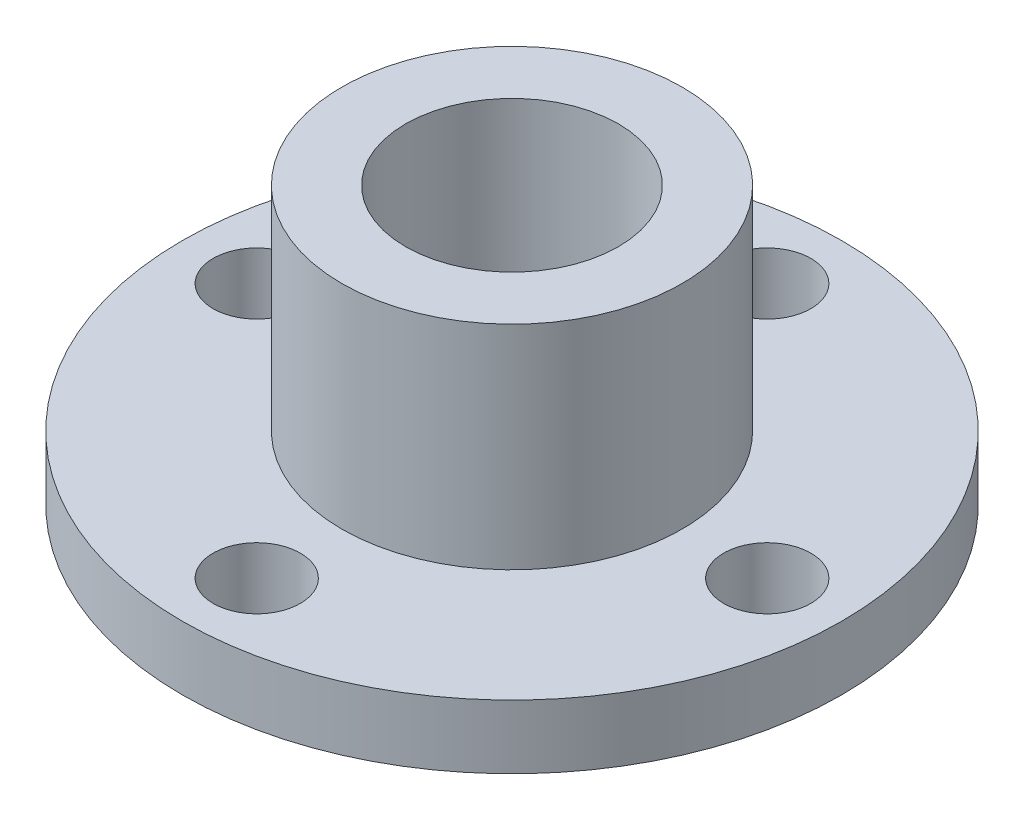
ISO-10303-21;
HEADER;
FILE_DESCRIPTION(('STEP AP214'),'2;1');
FILE_NAME('part.step','',(''),(''),'','','');
FILE_SCHEMA(('AUTOMOTIVE_DESIGN { 1 0 10303 214 1 1 1 1 }'));
ENDSEC;
DATA;
#1=APPLICATION_CONTEXT('core data for automotive mechanical design processes');
#2=APPLICATION_PROTOCOL_DEFINITION('international standard','automotive_design',2000,#1);
#3=PRODUCT_CONTEXT('',#1,'mechanical');
#4=PRODUCT('Part','Part','',(#3));
#5=PRODUCT_RELATED_PRODUCT_CATEGORY('part','',(#4));
#6=PRODUCT_DEFINITION_FORMATION('','',#4);
#7=PRODUCT_DEFINITION_CONTEXT('part definition',#1,'design');
#8=PRODUCT_DEFINITION('design','',#6,#7);
#9=PRODUCT_DEFINITION_SHAPE('','',#8);
#10=(LENGTH_UNIT() NAMED_UNIT(*) SI_UNIT(.MILLI.,.METRE.));
#11=(NAMED_UNIT(*) PLANE_ANGLE_UNIT() SI_UNIT($,.RADIAN.));
#12=(NAMED_UNIT(*) SI_UNIT($,.STERADIAN.) SOLID_ANGLE_UNIT());
#13=UNCERTAINTY_MEASURE_WITH_UNIT(LENGTH_MEASURE(1.E-05),#10,'distance_accuracy_value','');
#14=(GEOMETRIC_REPRESENTATION_CONTEXT(3) GLOBAL_UNCERTAINTY_ASSIGNED_CONTEXT((#13)) GLOBAL_UNIT_ASSIGNED_CONTEXT((#10,
#11,#12)) REPRESENTATION_CONTEXT('',''));
#15=CARTESIAN_POINT('',(0.,0.,0.));
#16=DIRECTION('',(0.,0.,1.));
#17=DIRECTION('',(1.,0.,0.));
#18=AXIS2_PLACEMENT_3D('',#15,#16,#17);
#19=CARTESIAN_POINT('',(0.,3.,0.));
#20=DIRECTION('',(0.,1.,0.));
#21=DIRECTION('',(0.,0.,1.));
#22=AXIS2_PLACEMENT_3D('',#19,#20,#21);
#23=PLANE('',#22);
#24=CARTESIAN_POINT('',(0.,3.,0.));
#25=DIRECTION('',(0.,1.,0.));
#26=DIRECTION('',(0.,0.,1.));
#27=AXIS2_PLACEMENT_3D('',#24,#25,#26);
#28=CIRCLE('',#27,5.);
#29=CARTESIAN_POINT('',(0.,3.,5.));
#30=VERTEX_POINT('',#29);
#31=EDGE_CURVE('E73',#30,#30,#28,.T.);
#32=ORIENTED_EDGE('',*,*,#31,.F.);
#33=EDGE_LOOP('',(#32));
#34=FACE_BOUND('',#33,.T.);
#35=CARTESIAN_POINT('',(0.,3.,0.));
#36=DIRECTION('',(0.,1.,0.));
#37=DIRECTION('',(0.,0.,1.));
#38=AXIS2_PLACEMENT_3D('',#35,#36,#37);
#39=CIRCLE('',#38,5.00319025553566);
#40=CARTESIAN_POINT('',(0.,3.,5.00319025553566));
#41=VERTEX_POINT('',#40);
#42=EDGE_CURVE('E205',#41,#41,#39,.T.);
#43=ORIENTED_EDGE('',*,*,#42,.T.);
#44=EDGE_LOOP('',(#43));
#45=FACE_BOUND('',#44,.T.);
#46=ADVANCED_FACE('F31',(#34,#45),#23,.T.);
#47=CARTESIAN_POINT('',(0.,3.,0.));
#48=DIRECTION('',(0.,1.,0.));
#49=DIRECTION('',(0.,0.,1.));
#50=AXIS2_PLACEMENT_3D('',#47,#48,#49);
#51=CIRCLE('',#50,8.);
#52=CARTESIAN_POINT('',(0.,3.,8.));
#53=VERTEX_POINT('',#52);
#54=EDGE_CURVE('E10',#53,#53,#51,.T.);
#55=ORIENTED_EDGE('',*,*,#54,.F.);
#56=EDGE_LOOP('',(#55));
#57=FACE_BOUND('',#56,.T.);
#58=CARTESIAN_POINT('',(0.,3.,12.));
#59=DIRECTION('',(0.,1.,0.));
#60=DIRECTION('',(0.,0.,1.));
#61=AXIS2_PLACEMENT_3D('',#58,#59,#60);
#62=CIRCLE('',#61,2.05);
#63=CARTESIAN_POINT('',(0.,3.,14.05));
#64=VERTEX_POINT('',#63);
#65=EDGE_CURVE('E55',#64,#64,#62,.T.);
#66=ORIENTED_EDGE('',*,*,#65,.F.);
#67=EDGE_LOOP('',(#66));
#68=FACE_BOUND('',#67,.T.);
#69=CARTESIAN_POINT('',(0.,3.,-12.));
#70=DIRECTION('',(0.,1.,0.));
#71=DIRECTION('',(0.,0.,1.));
#72=AXIS2_PLACEMENT_3D('',#69,#70,#71);
#73=CIRCLE('',#72,2.05);
#74=CARTESIAN_POINT('',(0.,3.,-9.95));
#75=VERTEX_POINT('',#74);
#76=EDGE_CURVE('E67',#75,#75,#73,.T.);
#77=ORIENTED_EDGE('',*,*,#76,.F.);
#78=EDGE_LOOP('',(#77));
#79=FACE_BOUND('',#78,.T.);
#80=CARTESIAN_POINT('',(0.,3.,0.));
#81=DIRECTION('',(0.,1.,0.));
#82=DIRECTION('',(0.,0.,1.));
#83=AXIS2_PLACEMENT_3D('',#80,#81,#82);
#84=CIRCLE('',#83,15.5);
#85=CARTESIAN_POINT('',(0.,3.,15.5));
#86=VERTEX_POINT('',#85);
#87=EDGE_CURVE('E39',#86,#86,#84,.T.);
#88=ORIENTED_EDGE('',*,*,#87,.T.);
#89=EDGE_LOOP('',(#88));
#90=FACE_BOUND('',#89,.T.);
#91=CARTESIAN_POINT('',(12.,3.,0.));
#92=DIRECTION('',(0.,1.,0.));
#93=DIRECTION('',(0.,0.,1.));
#94=AXIS2_PLACEMENT_3D('',#91,#92,#93);
#95=CIRCLE('',#94,2.05);
#96=CARTESIAN_POINT('',(12.,3.,2.05));
#97=VERTEX_POINT('',#96);
#98=EDGE_CURVE('E61',#97,#97,#95,.T.);
#99=ORIENTED_EDGE('',*,*,#98,.F.);
#100=EDGE_LOOP('',(#99));
#101=FACE_BOUND('',#100,.T.);
#102=CARTESIAN_POINT('',(-12.,3.,0.));
#103=DIRECTION('',(0.,1.,0.));
#104=DIRECTION('',(0.,0.,1.));
#105=AXIS2_PLACEMENT_3D('',#102,#103,#104);
#106=CIRCLE('',#105,2.05);
#107=CARTESIAN_POINT('',(-12.,3.,2.05000000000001));
#108=VERTEX_POINT('',#107);
#109=EDGE_CURVE('E48',#108,#108,#106,.T.);
#110=ORIENTED_EDGE('',*,*,#109,.F.);
#111=EDGE_LOOP('',(#110));
#112=FACE_BOUND('',#111,.T.);
#113=ADVANCED_FACE('F97',(#57,#68,#79,#90,#101,#112),#23,.T.);
#114=CARTESIAN_POINT('',(0.,0.,0.));
#115=DIRECTION('',(0.,1.,0.));
#116=DIRECTION('',(0.,0.,1.));
#117=AXIS2_PLACEMENT_3D('',#114,#115,#116);
#118=PLANE('',#117);
#119=CARTESIAN_POINT('',(0.,0.,0.));
#120=DIRECTION('',(0.,1.,0.));
#121=DIRECTION('',(0.,0.,1.));
#122=AXIS2_PLACEMENT_3D('',#119,#120,#121);
#123=CIRCLE('',#122,15.5);
#124=CARTESIAN_POINT('',(0.,0.,15.5));
#125=VERTEX_POINT('',#124);
#126=EDGE_CURVE('E35',#125,#125,#123,.T.);
#127=ORIENTED_EDGE('',*,*,#126,.F.);
#128=EDGE_LOOP('',(#127));
#129=FACE_BOUND('',#128,.T.);
#130=CARTESIAN_POINT('',(0.,0.,0.));
#131=DIRECTION('',(0.,1.,0.));
#132=DIRECTION('',(0.,0.,1.));
#133=AXIS2_PLACEMENT_3D('',#130,#131,#132);
#134=CIRCLE('',#133,5.);
#135=CARTESIAN_POINT('',(0.,0.,5.));
#136=VERTEX_POINT('',#135);
#137=EDGE_CURVE('E70',#136,#136,#134,.T.);
#138=ORIENTED_EDGE('',*,*,#137,.T.);
#139=EDGE_LOOP('',(#138));
#140=FACE_BOUND('',#139,.T.);
#141=CARTESIAN_POINT('',(0.,0.,-12.));
#142=DIRECTION('',(0.,1.,0.));
#143=DIRECTION('',(0.,0.,1.));
#144=AXIS2_PLACEMENT_3D('',#141,#142,#143);
#145=CIRCLE('',#144,2.05);
#146=CARTESIAN_POINT('',(0.,0.,-9.95));
#147=VERTEX_POINT('',#146);
#148=EDGE_CURVE('E64',#147,#147,#145,.T.);
#149=ORIENTED_EDGE('',*,*,#148,.T.);
#150=EDGE_LOOP('',(#149));
#151=FACE_BOUND('',#150,.T.);
#152=CARTESIAN_POINT('',(12.,0.,0.));
#153=DIRECTION('',(0.,1.,0.));
#154=DIRECTION('',(0.,0.,1.));
#155=AXIS2_PLACEMENT_3D('',#152,#153,#154);
#156=CIRCLE('',#155,2.05);
#157=CARTESIAN_POINT('',(12.,0.,2.05));
#158=VERTEX_POINT('',#157);
#159=EDGE_CURVE('E58',#158,#158,#156,.T.);
#160=ORIENTED_EDGE('',*,*,#159,.T.);
#161=EDGE_LOOP('',(#160));
#162=FACE_BOUND('',#161,.T.);
#163=CARTESIAN_POINT('',(0.,0.,12.));
#164=DIRECTION('',(0.,1.,0.));
#165=DIRECTION('',(0.,0.,1.));
#166=AXIS2_PLACEMENT_3D('',#163,#164,#165);
#167=CIRCLE('',#166,2.05);
#168=CARTESIAN_POINT('',(0.,0.,14.05));
#169=VERTEX_POINT('',#168);
#170=EDGE_CURVE('E51',#169,#169,#167,.T.);
#171=ORIENTED_EDGE('',*,*,#170,.T.);
#172=EDGE_LOOP('',(#171));
#173=FACE_BOUND('',#172,.T.);
#174=CARTESIAN_POINT('',(-12.,0.,0.));
#175=DIRECTION('',(0.,1.,0.));
#176=DIRECTION('',(0.,0.,1.));
#177=AXIS2_PLACEMENT_3D('',#174,#175,#176);
#178=CIRCLE('',#177,2.05);
#179=CARTESIAN_POINT('',(-12.,0.,2.05000000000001));
#180=VERTEX_POINT('',#179);
#181=EDGE_CURVE('E52',#180,#180,#178,.T.);
#182=ORIENTED_EDGE('',*,*,#181,.T.);
#183=EDGE_LOOP('',(#182));
#184=FACE_BOUND('',#183,.T.);
#185=ADVANCED_FACE('F79',(#129,#140,#151,#162,#173,#184),#118,.F.);
#186=CARTESIAN_POINT('',(0.,3.,0.));
#187=DIRECTION('',(0.,-1.,0.));
#188=DIRECTION('',(0.,0.,-1.));
#189=AXIS2_PLACEMENT_3D('',#186,#187,#188);
#190=CYLINDRICAL_SURFACE('',#189,15.5);
#191=ORIENTED_EDGE('',*,*,#87,.F.);
#192=EDGE_LOOP('',(#191));
#193=FACE_BOUND('',#192,.T.);
#194=ORIENTED_EDGE('',*,*,#126,.T.);
#195=EDGE_LOOP('',(#194));
#196=FACE_BOUND('',#195,.T.);
#197=ADVANCED_FACE('F33',(#193,#196),#190,.T.);
#198=CARTESIAN_POINT('',(0.,3.,0.));
#199=DIRECTION('',(0.,-1.,0.));
#200=DIRECTION('',(0.,0.,-1.));
#201=AXIS2_PLACEMENT_3D('',#198,#199,#200);
#202=CYLINDRICAL_SURFACE('',#201,5.);
#203=ORIENTED_EDGE('',*,*,#31,.T.);
#204=EDGE_LOOP('',(#203));
#205=FACE_BOUND('',#204,.T.);
#206=ORIENTED_EDGE('',*,*,#137,.F.);
#207=EDGE_LOOP('',(#206));
#208=FACE_BOUND('',#207,.T.);
#209=ADVANCED_FACE('F82',(#205,#208),#202,.F.);
#210=CARTESIAN_POINT('',(0.,3.,-12.));
#211=DIRECTION('',(0.,-1.,0.));
#212=DIRECTION('',(0.,0.,-1.));
#213=AXIS2_PLACEMENT_3D('',#210,#211,#212);
#214=CYLINDRICAL_SURFACE('',#213,2.05);
#215=ORIENTED_EDGE('',*,*,#76,.T.);
#216=EDGE_LOOP('',(#215));
#217=FACE_BOUND('',#216,.T.);
#218=ORIENTED_EDGE('',*,*,#148,.F.);
#219=EDGE_LOOP('',(#218));
#220=FACE_BOUND('',#219,.T.);
#221=ADVANCED_FACE('F84',(#217,#220),#214,.F.);
#222=CARTESIAN_POINT('',(12.,3.,0.));
#223=DIRECTION('',(0.,-1.,0.));
#224=DIRECTION('',(0.,0.,-1.));
#225=AXIS2_PLACEMENT_3D('',#222,#223,#224);
#226=CYLINDRICAL_SURFACE('',#225,2.05);
#227=ORIENTED_EDGE('',*,*,#98,.T.);
#228=EDGE_LOOP('',(#227));
#229=FACE_BOUND('',#228,.T.);
#230=ORIENTED_EDGE('',*,*,#159,.F.);
#231=EDGE_LOOP('',(#230));
#232=FACE_BOUND('',#231,.T.);
#233=ADVANCED_FACE('F91',(#229,#232),#226,.F.);
#234=CARTESIAN_POINT('',(0.,3.,12.));
#235=DIRECTION('',(0.,-1.,0.));
#236=DIRECTION('',(0.,0.,-1.));
#237=AXIS2_PLACEMENT_3D('',#234,#235,#236);
#238=CYLINDRICAL_SURFACE('',#237,2.05);
#239=ORIENTED_EDGE('',*,*,#65,.T.);
#240=EDGE_LOOP('',(#239));
#241=FACE_BOUND('',#240,.T.);
#242=ORIENTED_EDGE('',*,*,#170,.F.);
#243=EDGE_LOOP('',(#242));
#244=FACE_BOUND('',#243,.T.);
#245=ADVANCED_FACE('F137',(#241,#244),#238,.F.);
#246=CARTESIAN_POINT('',(-12.,3.,0.));
#247=DIRECTION('',(0.,-1.,0.));
#248=DIRECTION('',(0.,0.,-1.));
#249=AXIS2_PLACEMENT_3D('',#246,#247,#248);
#250=CYLINDRICAL_SURFACE('',#249,2.05);
#251=ORIENTED_EDGE('',*,*,#109,.T.);
#252=EDGE_LOOP('',(#251));
#253=FACE_BOUND('',#252,.T.);
#254=ORIENTED_EDGE('',*,*,#181,.F.);
#255=EDGE_LOOP('',(#254));
#256=FACE_BOUND('',#255,.T.);
#257=ADVANCED_FACE('F147',(#253,#256),#250,.F.);
#258=CARTESIAN_POINT('',(0.,13.,0.));
#259=DIRECTION('',(0.,1.,0.));
#260=DIRECTION('',(0.,0.,1.));
#261=AXIS2_PLACEMENT_3D('',#258,#259,#260);
#262=PLANE('',#261);
#263=CARTESIAN_POINT('',(0.,13.,0.));
#264=DIRECTION('',(0.,1.,0.));
#265=DIRECTION('',(0.,0.,1.));
#266=AXIS2_PLACEMENT_3D('',#263,#264,#265);
#267=CIRCLE('',#266,8.);
#268=CARTESIAN_POINT('',(0.,13.,8.));
#269=VERTEX_POINT('',#268);
#270=EDGE_CURVE('E46',#269,#269,#267,.T.);
#271=ORIENTED_EDGE('',*,*,#270,.T.);
#272=EDGE_LOOP('',(#271));
#273=FACE_BOUND('',#272,.T.);
#274=CARTESIAN_POINT('',(0.,13.,0.));
#275=DIRECTION('',(0.,1.,0.));
#276=DIRECTION('',(0.,0.,1.));
#277=AXIS2_PLACEMENT_3D('',#274,#275,#276);
#278=CIRCLE('',#277,5.00319025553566);
#279=CARTESIAN_POINT('',(0.,13.,5.00319025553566));
#280=VERTEX_POINT('',#279);
#281=EDGE_CURVE('E202',#280,#280,#278,.T.);
#282=ORIENTED_EDGE('',*,*,#281,.F.);
#283=EDGE_LOOP('',(#282));
#284=FACE_BOUND('',#283,.T.);
#285=ADVANCED_FACE('F156',(#273,#284),#262,.T.);
#286=CARTESIAN_POINT('',(0.,13.,0.));
#287=DIRECTION('',(0.,-1.,0.));
#288=DIRECTION('',(0.,0.,-1.));
#289=AXIS2_PLACEMENT_3D('',#286,#287,#288);
#290=CYLINDRICAL_SURFACE('',#289,8.);
#291=ORIENTED_EDGE('',*,*,#270,.F.);
#292=EDGE_LOOP('',(#291));
#293=FACE_BOUND('',#292,.T.);
#294=ORIENTED_EDGE('',*,*,#54,.T.);
#295=EDGE_LOOP('',(#294));
#296=FACE_BOUND('',#295,.T.);
#297=ADVANCED_FACE('F175',(#293,#296),#290,.T.);
#298=CARTESIAN_POINT('',(0.,13.,0.));
#299=DIRECTION('',(0.,-1.,0.));
#300=DIRECTION('',(0.,0.,-1.));
#301=AXIS2_PLACEMENT_3D('',#298,#299,#300);
#302=CYLINDRICAL_SURFACE('',#301,5.00319025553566);
#303=ORIENTED_EDGE('',*,*,#281,.T.);
#304=EDGE_LOOP('',(#303));
#305=FACE_BOUND('',#304,.T.);
#306=ORIENTED_EDGE('',*,*,#42,.F.);
#307=EDGE_LOOP('',(#306));
#308=FACE_BOUND('',#307,.T.);
#309=ADVANCED_FACE('F185',(#305,#308),#302,.F.);
#310=CLOSED_SHELL('',(#46,#113,#185,#197,#209,#221,#233,#245,#257,#285,#297,#309));
#311=MANIFOLD_SOLID_BREP('B2',#310);
#312=ADVANCED_BREP_SHAPE_REPRESENTATION('',(#18,#311),#14);
#313=SHAPE_DEFINITION_REPRESENTATION(#9,#312);
ENDSEC;
END-ISO-10303-21;
